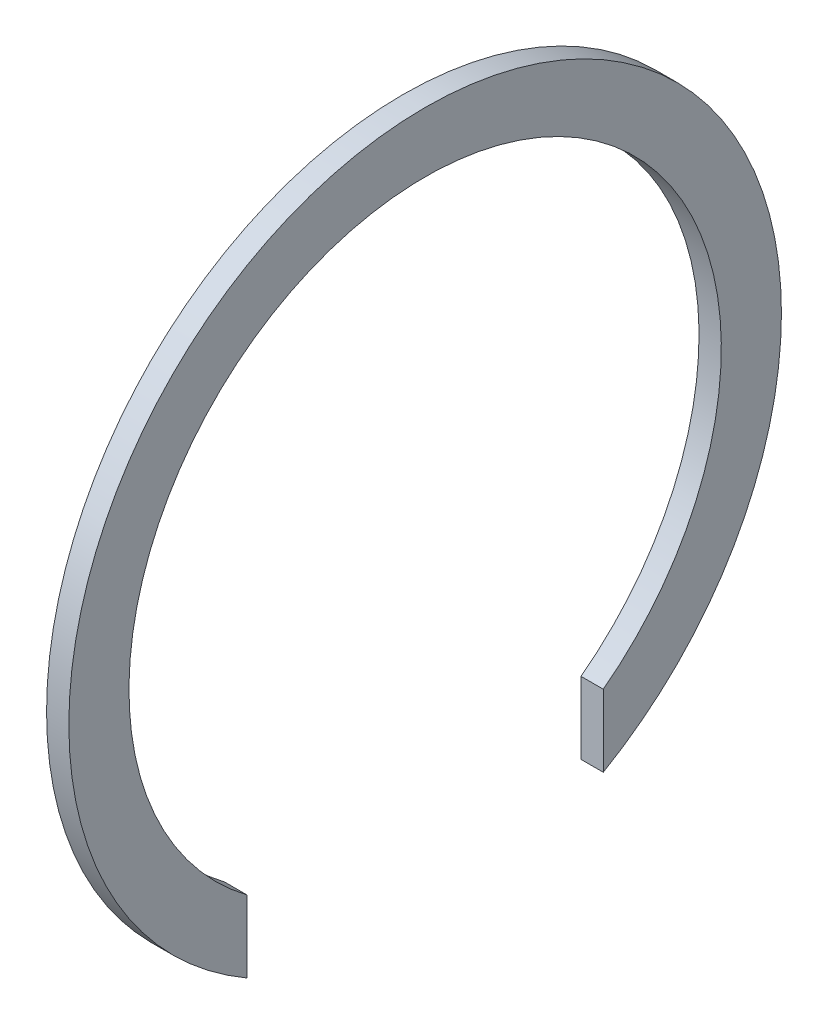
from build123d import *

# Parameters (mm, degrees)
EXTRUSION1_DEPTH = 0.5


with BuildPart() as part:
    # Esquisse1 → Extrusion1 (new body)
    with BuildSketch(Plane(origin=(0, 0, 0), x_dir=(0, 0, -1), z_dir=(1, 0, 0))):
        with BuildLine():
            Line((-4, -5.312485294), (-4, -6.92820323))
            ThreePointArc((-4, -6.92820323), (0, 8), (4, -6.92820323))
            Line((4, -6.92820323), (4, -5.312485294))
            ThreePointArc((4, -5.312485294), (0, 6.65), (-4, -5.312485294))
        make_face()
    extrude(amount=EXTRUSION1_DEPTH)


solid = part.part
